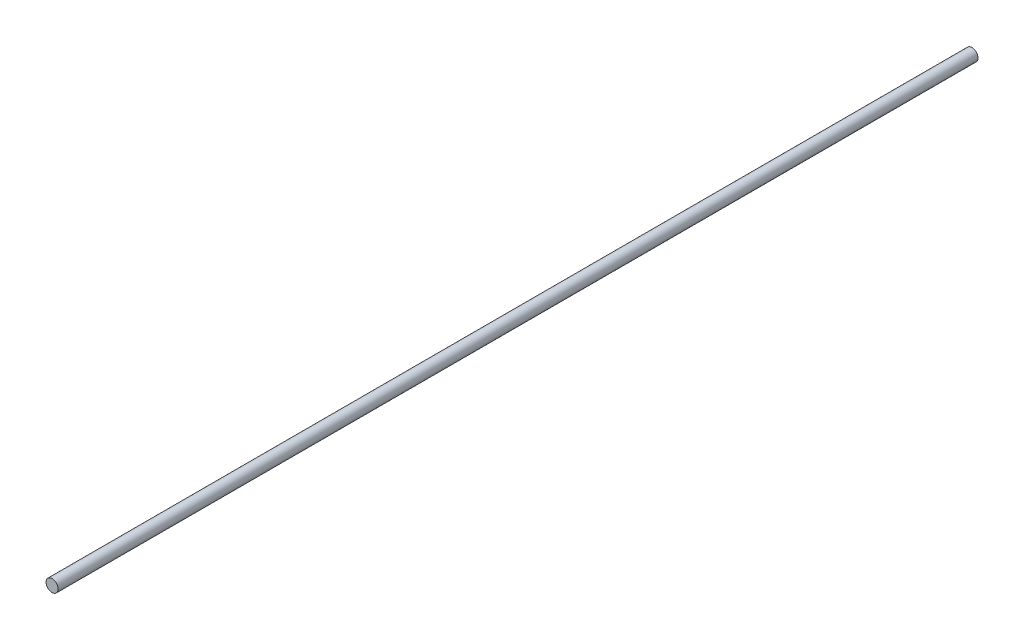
ISO-10303-21;
HEADER;
FILE_DESCRIPTION(('STEP AP214'),'2;1');
FILE_NAME('part.step','',(''),(''),'','','');
FILE_SCHEMA(('AUTOMOTIVE_DESIGN { 1 0 10303 214 1 1 1 1 }'));
ENDSEC;
DATA;
#1=APPLICATION_CONTEXT('core data for automotive mechanical design processes');
#2=APPLICATION_PROTOCOL_DEFINITION('international standard','automotive_design',2000,#1);
#3=PRODUCT_CONTEXT('',#1,'mechanical');
#4=PRODUCT('Part','Part','',(#3));
#5=PRODUCT_RELATED_PRODUCT_CATEGORY('part','',(#4));
#6=PRODUCT_DEFINITION_FORMATION('','',#4);
#7=PRODUCT_DEFINITION_CONTEXT('part definition',#1,'design');
#8=PRODUCT_DEFINITION('design','',#6,#7);
#9=PRODUCT_DEFINITION_SHAPE('','',#8);
#10=(LENGTH_UNIT() NAMED_UNIT(*) SI_UNIT(.MILLI.,.METRE.));
#11=(NAMED_UNIT(*) PLANE_ANGLE_UNIT() SI_UNIT($,.RADIAN.));
#12=(NAMED_UNIT(*) SI_UNIT($,.STERADIAN.) SOLID_ANGLE_UNIT());
#13=UNCERTAINTY_MEASURE_WITH_UNIT(LENGTH_MEASURE(1.E-05),#10,'distance_accuracy_value','');
#14=(GEOMETRIC_REPRESENTATION_CONTEXT(3) GLOBAL_UNCERTAINTY_ASSIGNED_CONTEXT((#13)) GLOBAL_UNIT_ASSIGNED_CONTEXT((#10,
#11,#12)) REPRESENTATION_CONTEXT('',''));
#15=CARTESIAN_POINT('',(0.,0.,0.));
#16=DIRECTION('',(0.,0.,1.));
#17=DIRECTION('',(1.,0.,0.));
#18=AXIS2_PLACEMENT_3D('',#15,#16,#17);
#19=CARTESIAN_POINT('',(0.,0.,482.6));
#20=DIRECTION('',(0.,0.,-1.));
#21=DIRECTION('',(-1.,0.,0.));
#22=AXIS2_PLACEMENT_3D('',#19,#20,#21);
#23=CYLINDRICAL_SURFACE('',#22,6.35);
#24=CARTESIAN_POINT('',(0.,0.,482.6));
#25=DIRECTION('',(0.,0.,1.));
#26=DIRECTION('',(1.,0.,0.));
#27=AXIS2_PLACEMENT_3D('',#24,#25,#26);
#28=CIRCLE('',#27,6.35);
#29=CARTESIAN_POINT('',(-6.35,0.,482.6));
#30=VERTEX_POINT('',#29);
#31=EDGE_CURVE('E10',#30,#30,#28,.T.);
#32=CARTESIAN_POINT('',(0.,0.,-482.6));
#33=DIRECTION('',(0.,0.,1.));
#34=DIRECTION('',(1.,0.,0.));
#35=AXIS2_PLACEMENT_3D('',#32,#33,#34);
#36=CIRCLE('',#35,6.35);
#37=CARTESIAN_POINT('',(-6.35,0.,-482.6));
#38=VERTEX_POINT('',#37);
#39=EDGE_CURVE('E34',#38,#38,#36,.T.);
#40=CARTESIAN_POINT('',(-6.35,0.,482.6));
#41=CARTESIAN_POINT('',(-6.35,0.,472.545833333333));
#42=CARTESIAN_POINT('',(-6.35,0.,462.491666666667));
#43=CARTESIAN_POINT('',(-6.35,0.,442.383333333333));
#44=CARTESIAN_POINT('',(-6.35,0.,432.329166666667));
#45=CARTESIAN_POINT('',(-6.35,0.,412.220833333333));
#46=CARTESIAN_POINT('',(-6.35,0.,402.166666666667));
#47=CARTESIAN_POINT('',(-6.35,0.,382.058333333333));
#48=CARTESIAN_POINT('',(-6.35,0.,372.004166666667));
#49=CARTESIAN_POINT('',(-6.35,0.,351.895833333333));
#50=CARTESIAN_POINT('',(-6.35,0.,341.841666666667));
#51=CARTESIAN_POINT('',(-6.35,0.,321.733333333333));
#52=CARTESIAN_POINT('',(-6.35,0.,311.679166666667));
#53=CARTESIAN_POINT('',(-6.35,0.,291.570833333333));
#54=CARTESIAN_POINT('',(-6.35,0.,281.516666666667));
#55=CARTESIAN_POINT('',(-6.35,0.,261.408333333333));
#56=CARTESIAN_POINT('',(-6.35,0.,251.354166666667));
#57=CARTESIAN_POINT('',(-6.35,0.,231.245833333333));
#58=CARTESIAN_POINT('',(-6.35,0.,221.191666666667));
#59=CARTESIAN_POINT('',(-6.35,0.,201.083333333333));
#60=CARTESIAN_POINT('',(-6.35,0.,191.029166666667));
#61=CARTESIAN_POINT('',(-6.35,0.,170.920833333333));
#62=CARTESIAN_POINT('',(-6.35,0.,160.866666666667));
#63=CARTESIAN_POINT('',(-6.35,0.,140.758333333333));
#64=CARTESIAN_POINT('',(-6.35,0.,130.704166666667));
#65=CARTESIAN_POINT('',(-6.35,0.,110.595833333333));
#66=CARTESIAN_POINT('',(-6.35,0.,100.541666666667));
#67=CARTESIAN_POINT('',(-6.35,0.,80.4333333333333));
#68=CARTESIAN_POINT('',(-6.35,0.,70.3791666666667));
#69=CARTESIAN_POINT('',(-6.35,0.,50.2708333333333));
#70=CARTESIAN_POINT('',(-6.35,0.,40.2166666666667));
#71=CARTESIAN_POINT('',(-6.35,0.,20.1083333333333));
#72=CARTESIAN_POINT('',(-6.35,0.,10.0541666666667));
#73=CARTESIAN_POINT('',(-6.35,0.,-10.0541666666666));
#74=CARTESIAN_POINT('',(-6.35,0.,-20.1083333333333));
#75=CARTESIAN_POINT('',(-6.35,0.,-40.2166666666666));
#76=CARTESIAN_POINT('',(-6.35,0.,-50.2708333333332));
#77=CARTESIAN_POINT('',(-6.35,0.,-70.3791666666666));
#78=CARTESIAN_POINT('',(-6.35,0.,-80.4333333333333));
#79=CARTESIAN_POINT('',(-6.35,0.,-100.541666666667));
#80=CARTESIAN_POINT('',(-6.35,0.,-110.595833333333));
#81=CARTESIAN_POINT('',(-6.35,0.,-130.704166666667));
#82=CARTESIAN_POINT('',(-6.35,0.,-140.758333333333));
#83=CARTESIAN_POINT('',(-6.35,0.,-160.866666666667));
#84=CARTESIAN_POINT('',(-6.35,0.,-170.920833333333));
#85=CARTESIAN_POINT('',(-6.35,0.,-191.029166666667));
#86=CARTESIAN_POINT('',(-6.35,0.,-201.083333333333));
#87=CARTESIAN_POINT('',(-6.35,0.,-221.191666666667));
#88=CARTESIAN_POINT('',(-6.35,0.,-231.245833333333));
#89=CARTESIAN_POINT('',(-6.35,0.,-251.354166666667));
#90=CARTESIAN_POINT('',(-6.35,0.,-261.408333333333));
#91=CARTESIAN_POINT('',(-6.35,0.,-281.516666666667));
#92=CARTESIAN_POINT('',(-6.35,0.,-291.570833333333));
#93=CARTESIAN_POINT('',(-6.35,0.,-311.679166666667));
#94=CARTESIAN_POINT('',(-6.35,0.,-321.733333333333));
#95=CARTESIAN_POINT('',(-6.35,0.,-341.841666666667));
#96=CARTESIAN_POINT('',(-6.35,0.,-351.895833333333));
#97=CARTESIAN_POINT('',(-6.35,0.,-372.004166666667));
#98=CARTESIAN_POINT('',(-6.35,0.,-382.058333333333));
#99=CARTESIAN_POINT('',(-6.35,0.,-402.166666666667));
#100=CARTESIAN_POINT('',(-6.35,0.,-412.220833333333));
#101=CARTESIAN_POINT('',(-6.35,0.,-432.329166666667));
#102=CARTESIAN_POINT('',(-6.35,0.,-442.383333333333));
#103=CARTESIAN_POINT('',(-6.35,0.,-462.491666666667));
#104=CARTESIAN_POINT('',(-6.35,0.,-472.545833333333));
#105=CARTESIAN_POINT('',(-6.35,0.,-482.6));
#106=B_SPLINE_CURVE_WITH_KNOTS('',3,(#40,#41,#42,#43,#44,#45,#46,#47,#48,#49,#50,#51,#52,#53,
#54,#55,#56,#57,#58,#59,#60,#61,#62,#63,#64,#65,#66,#67,#68,#69,#70,#71,#72,#73,#74,#75,#76,#77,
#78,#79,#80,#81,#82,#83,#84,#85,#86,#87,#88,#89,#90,#91,#92,#93,#94,#95,#96,#97,#98,#99,#100,
#101,#102,#103,#104,#105),.UNSPECIFIED.,.F.,.F.,(4,2,2,2,2,2,2,2,2,2,2,2,2,2,2,2,2,2,2,2,2,2,2,
2,2,2,2,2,2,2,2,2,4),(0.,30.1625,60.325,90.4875,120.65,150.8125,180.975,211.1375,241.3,271.4625,
301.625,331.7875,361.95,392.1125,422.275,452.4375,482.6,512.7625,542.925,573.0875,603.25,
633.4125,663.575,693.7375,723.9,754.0625,784.225,814.3875,844.55,874.7125,904.875,935.0375,
965.2),.UNSPECIFIED.);
#107=EDGE_CURVE('BSEAM31',#30,#38,#106,.T.);
#108=ORIENTED_EDGE('',*,*,#31,.F.);
#109=ORIENTED_EDGE('',*,*,#39,.T.);
#110=ORIENTED_EDGE('',*,*,#107,.T.);
#111=ORIENTED_EDGE('',*,*,#107,.F.);
#112=EDGE_LOOP('',(#108,#110,#109,#111));
#113=FACE_BOUND('',#112,.T.);
#114=ADVANCED_FACE('F31',(#113),#23,.T.);
#115=CARTESIAN_POINT('',(0.,0.,482.6));
#116=DIRECTION('',(0.,0.,1.));
#117=DIRECTION('',(1.,0.,0.));
#118=AXIS2_PLACEMENT_3D('',#115,#116,#117);
#119=PLANE('',#118);
#120=ORIENTED_EDGE('',*,*,#31,.T.);
#121=EDGE_LOOP('',(#120));
#122=FACE_BOUND('',#121,.T.);
#123=ADVANCED_FACE('F46',(#122),#119,.T.);
#124=CARTESIAN_POINT('',(0.,0.,-482.6));
#125=DIRECTION('',(0.,0.,1.));
#126=DIRECTION('',(1.,0.,0.));
#127=AXIS2_PLACEMENT_3D('',#124,#125,#126);
#128=PLANE('',#127);
#129=ORIENTED_EDGE('',*,*,#39,.F.);
#130=EDGE_LOOP('',(#129));
#131=FACE_BOUND('',#130,.T.);
#132=ADVANCED_FACE('F44',(#131),#128,.F.);
#133=CLOSED_SHELL('',(#114,#123,#132));
#134=MANIFOLD_SOLID_BREP('B2',#133);
#135=ADVANCED_BREP_SHAPE_REPRESENTATION('',(#18,#134),#14);
#136=SHAPE_DEFINITION_REPRESENTATION(#9,#135);
ENDSEC;
END-ISO-10303-21;
